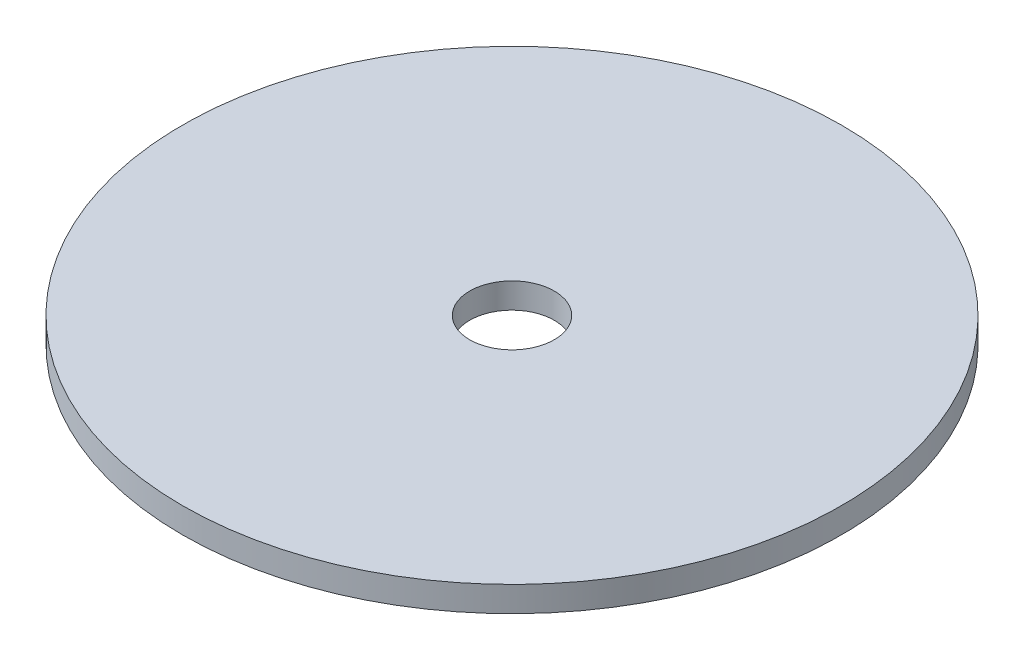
from build123d import *

# Parameters (mm, degrees)
ESQUISSE1_R        = 39
ESQUISSE1_R_2      = 5
BOSS_EXTRU_1_DEPTH = 1.5


with BuildPart() as part:
    # Esquisse1 → Boss.-Extru.1 (new, symmetric)
    with BuildSketch(Plane(origin=(0, 0, 0), x_dir=(1, 0, 0), z_dir=(0, 1, 0))):
        with Locations(Location((0, 0, 0), (0, 0, 270))):
            Circle(ESQUISSE1_R)
        with Locations(Location((0, 0, 0), (0, 0, 270))):
            Circle(ESQUISSE1_R_2, mode=Mode.SUBTRACT)
    extrude(amount=BOSS_EXTRU_1_DEPTH, both=True)


solid = part.part
